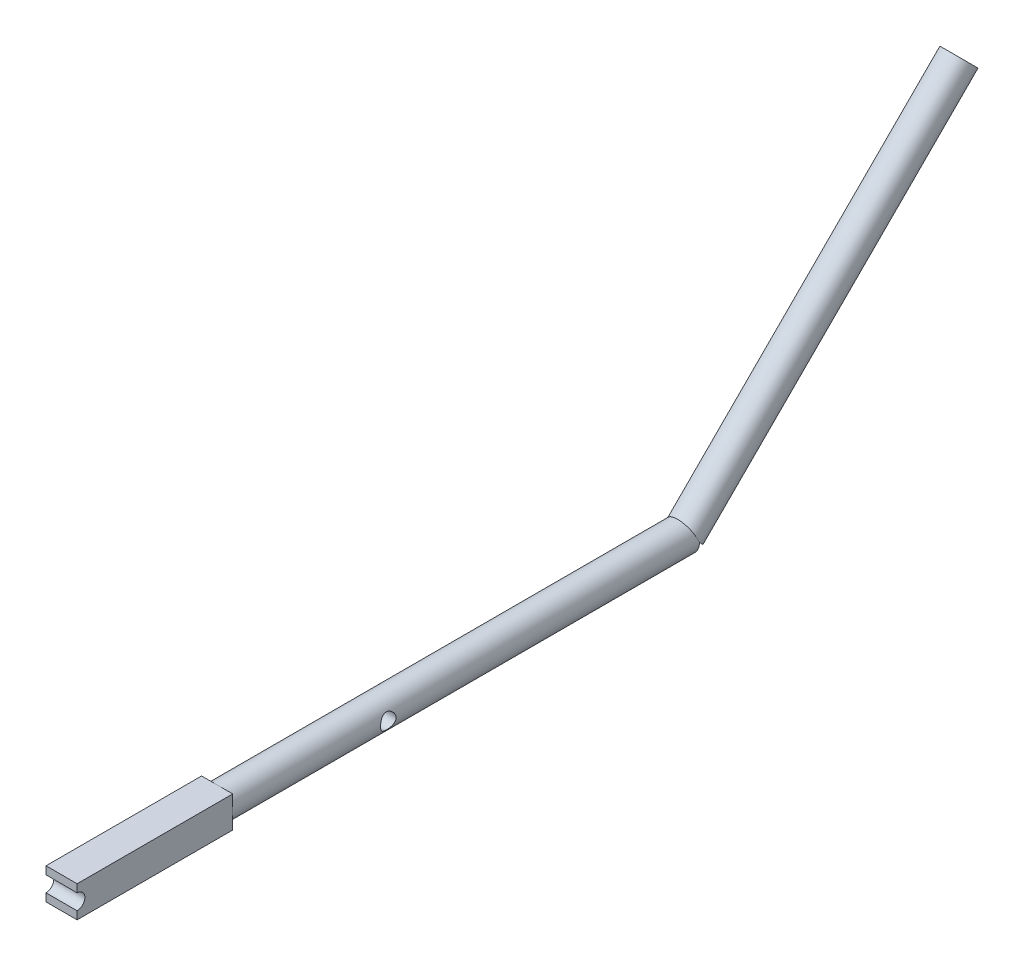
from build123d import *

# Parameters (mm, degrees)
BOSS_EXTRUDE1_DEPTH            = 400
BOSS_EXTRUDE1_DEPTH_BACK       = 400
SKETCH1_R                      = 20
SKETCH2_R                      = 20.000000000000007
BOSS_EXTRUDE2_DEPTH            = 500
SKETCH5_W                      = 40
SKETCH5_H                      = 40.2371121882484
BOSS_EXTRUDE3_DEPTH            = 200
CUT_EXTRUDE1_REACH             = 853.444
SKETCH3_R                      = 9.99999999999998
CUT_EXTRUDE1_DIRECTION_2_REACH = 853.444
CUT_EXTRUDE2_DEPTH             = 852.443727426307
CUT_EXTRUDE2_DEPTH_BACK        = 852.443727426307
SKETCH4_R                      = 10


with BuildPart() as part:
    # Sketch1 → Boss-Extrude1 (new, two sides: drawn at the far end of the back side and taken through both)
    with BuildSketch(Plane.XY.offset(-BOSS_EXTRUDE1_DEPTH_BACK)):
        Circle(SKETCH1_R)
    extrude(amount=BOSS_EXTRUDE1_DEPTH + BOSS_EXTRUDE1_DEPTH_BACK)

    # Sketch2 → Boss-Extrude2 (add)
    with BuildSketch(Plane(origin=(0, 200.00000000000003, -199.99999999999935), x_dir=(-1, 0, 0), z_dir=(0, 0.7071067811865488, -0.7071067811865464))):
        with Locations((2.7e-15, -282.84271247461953)):
            Circle(SKETCH2_R)
    extrude(amount=BOSS_EXTRUDE2_DEPTH)

    # Sketch5 → Boss-Extrude3 (add)
    with BuildSketch(Plane.XY.offset(400)):
        Rectangle(SKETCH5_W, SKETCH5_H)
    extrude(amount=-BOSS_EXTRUDE3_DEPTH)

    # Sketch3 → Cut-Extrude1 (cut, up to next)
    with BuildSketch(Plane(origin=(0, 0, 0), x_dir=(0, 0, -1), z_dir=(1, 0, 0)), mode=Mode.PRIVATE) as cut_extrude1_sk1:
        with Locations((-400, 0)):
            Circle(SKETCH3_R)
    cut_extrude1_tool1 = extrude(cut_extrude1_sk1.sketch, amount=-CUT_EXTRUDE1_REACH, mode=Mode.PRIVATE) & part.part
    add(cut_extrude1_tool1.solids().sort_by_distance((0, 0, 400))[0], mode=Mode.SUBTRACT)

    # Sketch3 → Cut-Extrude1 direction 2 (cut, up to next)
    with BuildSketch(Plane(origin=(0, 0, 0), x_dir=(0, 0, -1), z_dir=(1, 0, 0)), mode=Mode.PRIVATE) as cut_extrude1_direction_2_sk1:
        with Locations((-400, 0)):
            Circle(SKETCH3_R)
    cut_extrude1_direction_2_tool1 = extrude(cut_extrude1_direction_2_sk1.sketch, amount=CUT_EXTRUDE1_DIRECTION_2_REACH, mode=Mode.PRIVATE) & part.part
    add(cut_extrude1_direction_2_tool1.solids().sort_by_distance((0, 0, 400))[0], mode=Mode.SUBTRACT)

    # Sketch4 → Cut-Extrude2 (cut, two sides: drawn at the far end of the back side and taken through both)
    with BuildSketch(Plane(origin=(0, 0, 0), x_dir=(0, 0, -1), z_dir=(1, 0, 0)).offset(-CUT_EXTRUDE2_DEPTH_BACK)):
        Circle(SKETCH4_R)
    extrude(amount=CUT_EXTRUDE2_DEPTH + CUT_EXTRUDE2_DEPTH_BACK, mode=Mode.SUBTRACT)


solid = part.part
